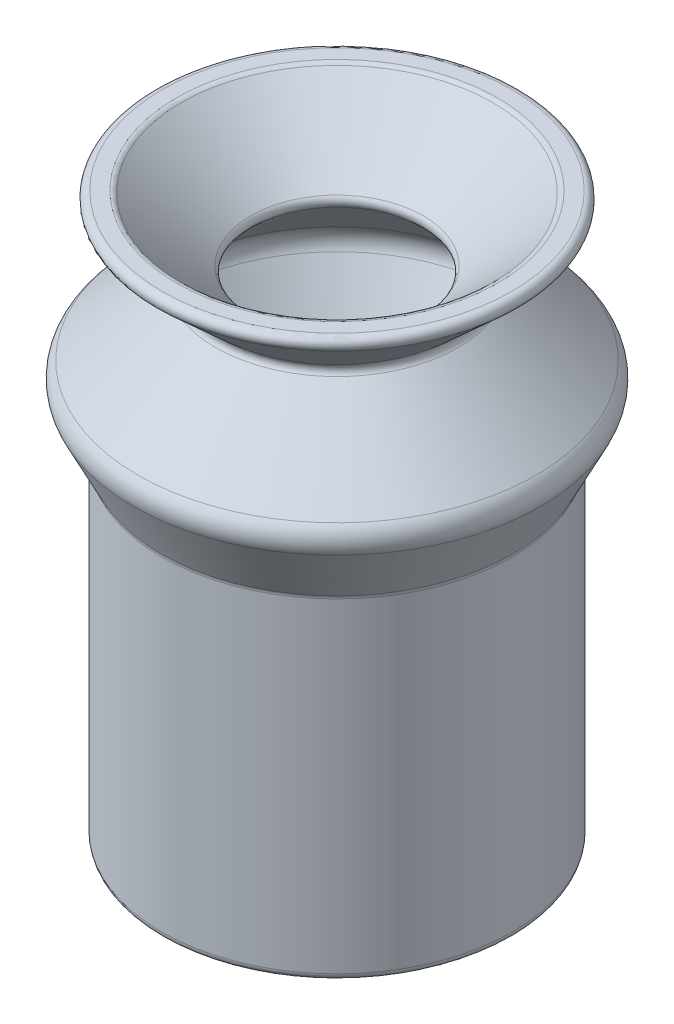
from build123d import *

# Parameters (mm, degrees)
SKETCH_1_R          = 5
EXTRUDE_1_DEPTH     = 9.5
SKETCH_4_R          = 2.3
CUT_EXTRUDE_1_DEPTH = 9.5
FILLET_1_R          = 0.2
FILLET_2_R          = 0.6


with BuildPart() as part:
    # Sketch 1 → Extrude 1 (new body)
    with BuildSketch(Plane(origin=(0, 0, 0), x_dir=(1, 0, 0), z_dir=(0, 1, 0))):
        with Locations(Location((0, 0, 0), (0, 0, 270))):
            Circle(SKETCH_1_R)
    extrude(amount=EXTRUDE_1_DEPTH)

    # Sketch 2 → Revolve 1 (revolve)
    with BuildSketch(Plane(origin=(0, 0, 0), x_dir=(0, 0, -1), z_dir=(1, 0, 0))):
        Polygon((0, 9.5), (-5, 9.5), (-6, 11.5), (-3.3, 14), (-5.5, 16), (0, 16), align=None)
    revolve(axis=Axis((0, 16, 0), (0, -1, 0)))

    # Sketch 3 → Cut-Revolve 1 (revolve, cut)
    with BuildSketch(Plane(origin=(0, 0, 0), x_dir=(0, 0, -1), z_dir=(1, 0, 0))):
        Polygon((0, 9.5), (-4, 9.5), (-5, 11.5), (-2.3, 14), (-4.5, 16), (0, 16), align=None)
    revolve(axis=Axis((0, 16, 0), (0, -1, 0)), mode=Mode.SUBTRACT)

    # Sketch 4 → Cut-Extrude 1 (cut)
    with BuildSketch(Plane.XZ):
        with Locations(Location((0, 0, 0), (0, 0, 270))):
            Circle(SKETCH_4_R)
    extrude(amount=-CUT_EXTRUDE_1_DEPTH, mode=Mode.SUBTRACT)

    # Fillet 1
    fillet_1_edges = [part.edges().sort_by_distance(p)[0] for p in [
        (0, 9.5, -4),
        (0, 14, -2.3),
        (0, 16, -4.5),
        (0, 9.5, 2.3),
        (0, 0, 2.3),
        (0, 0, -5),
        (0, 9.5, -5),
        (0, 14, -3.3),
        (0, 16, -5.5),
    ]]
    fillet(fillet_1_edges, radius=FILLET_1_R)

    # Fillet 2
    fillet_2_edges = [part.edges().sort_by_distance(p)[0] for p in [
        (0, 11.5, -5),
        (0, 11.5, -6),
    ]]
    fillet(fillet_2_edges, radius=FILLET_2_R)


solid = part.part
